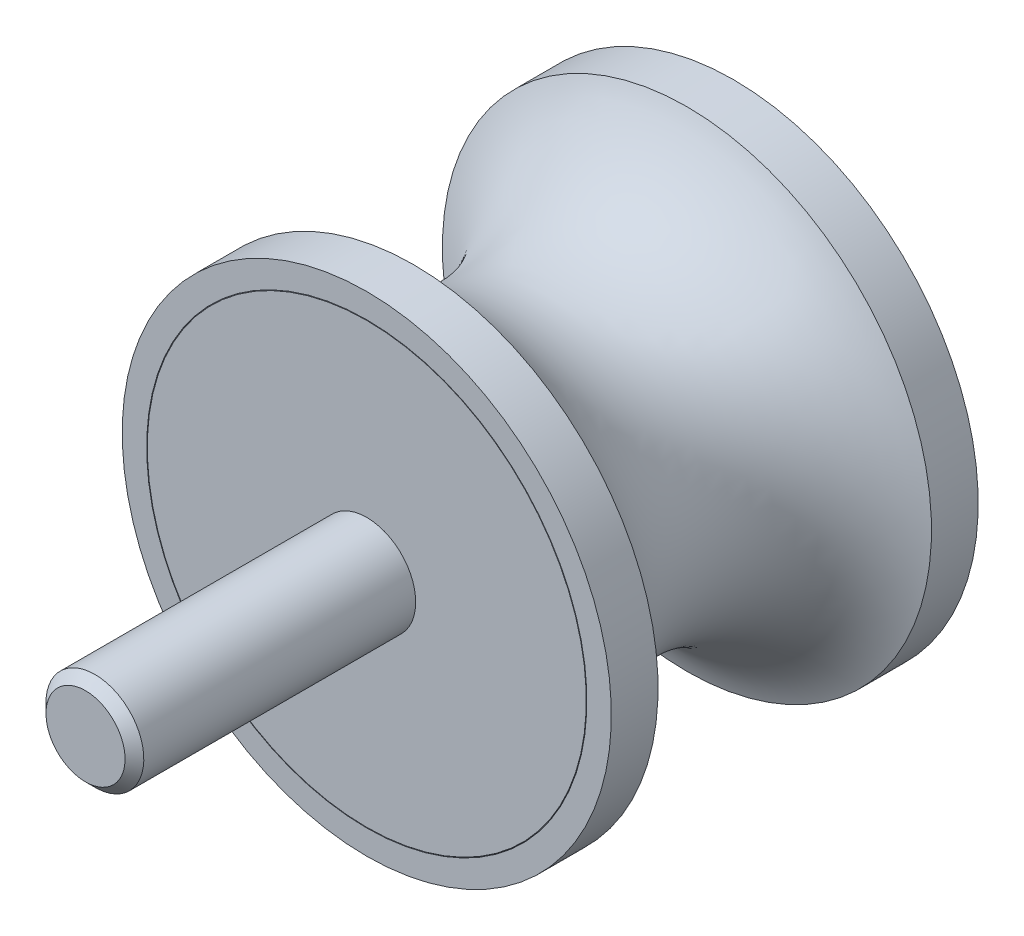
ISO-10303-21;
HEADER;
FILE_DESCRIPTION(('STEP AP214'),'2;1');
FILE_NAME('part.step','',(''),(''),'','','');
FILE_SCHEMA(('AUTOMOTIVE_DESIGN { 1 0 10303 214 1 1 1 1 }'));
ENDSEC;
DATA;
#1=APPLICATION_CONTEXT('core data for automotive mechanical design processes');
#2=APPLICATION_PROTOCOL_DEFINITION('international standard','automotive_design',2000,#1);
#3=PRODUCT_CONTEXT('',#1,'mechanical');
#4=PRODUCT('Part','Part','',(#3));
#5=PRODUCT_RELATED_PRODUCT_CATEGORY('part','',(#4));
#6=PRODUCT_DEFINITION_FORMATION('','',#4);
#7=PRODUCT_DEFINITION_CONTEXT('part definition',#1,'design');
#8=PRODUCT_DEFINITION('design','',#6,#7);
#9=PRODUCT_DEFINITION_SHAPE('','',#8);
#10=(LENGTH_UNIT() NAMED_UNIT(*) SI_UNIT(.MILLI.,.METRE.));
#11=(NAMED_UNIT(*) PLANE_ANGLE_UNIT() SI_UNIT($,.RADIAN.));
#12=(NAMED_UNIT(*) SI_UNIT($,.STERADIAN.) SOLID_ANGLE_UNIT());
#13=UNCERTAINTY_MEASURE_WITH_UNIT(LENGTH_MEASURE(1.E-05),#10,'distance_accuracy_value','');
#14=(GEOMETRIC_REPRESENTATION_CONTEXT(3) GLOBAL_UNCERTAINTY_ASSIGNED_CONTEXT((#13)) GLOBAL_UNIT_ASSIGNED_CONTEXT((#10,
#11,#12)) REPRESENTATION_CONTEXT('',''));
#15=CARTESIAN_POINT('',(0.,0.,0.));
#16=DIRECTION('',(0.,0.,1.));
#17=DIRECTION('',(1.,0.,0.));
#18=AXIS2_PLACEMENT_3D('',#15,#16,#17);
#19=CARTESIAN_POINT('',(0.,0.,0.5));
#20=DIRECTION('',(0.,0.,-1.));
#21=DIRECTION('',(0.,1.,0.));
#22=AXIS2_PLACEMENT_3D('',#19,#20,#21);
#23=CYLINDRICAL_SURFACE('',#22,18.);
#24=CARTESIAN_POINT('',(0.,0.,0.05));
#25=DIRECTION('',(0.,0.,-1.));
#26=DIRECTION('',(0.,1.,0.));
#27=AXIS2_PLACEMENT_3D('',#24,#25,#26);
#28=CIRCLE('',#27,18.);
#29=CARTESIAN_POINT('',(0.,18.,0.05));
#30=VERTEX_POINT('',#29);
#31=EDGE_CURVE('E53',#30,#30,#28,.T.);
#32=ORIENTED_EDGE('',*,*,#31,.F.);
#33=EDGE_LOOP('',(#32));
#34=FACE_BOUND('',#33,.T.);
#35=CARTESIAN_POINT('',(0.,0.,0.));
#36=DIRECTION('',(0.,0.,-1.));
#37=DIRECTION('',(0.,1.,0.));
#38=AXIS2_PLACEMENT_3D('',#35,#36,#37);
#39=CIRCLE('',#38,18.);
#40=CARTESIAN_POINT('',(0.,18.,0.));
#41=VERTEX_POINT('',#40);
#42=EDGE_CURVE('E44',#41,#41,#39,.T.);
#43=ORIENTED_EDGE('',*,*,#42,.T.);
#44=EDGE_LOOP('',(#43));
#45=FACE_BOUND('',#44,.T.);
#46=ADVANCED_FACE('F12',(#34,#45),#23,.F.);
#47=CARTESIAN_POINT('',(0.,0.,0.5));
#48=DIRECTION('',(0.,0.,-1.));
#49=DIRECTION('',(0.,1.,0.));
#50=AXIS2_PLACEMENT_3D('',#47,#48,#49);
#51=CYLINDRICAL_SURFACE('',#50,18.);
#52=CARTESIAN_POINT('',(0.,0.,30.));
#53=DIRECTION('',(0.,0.,-1.));
#54=DIRECTION('',(0.,1.,0.));
#55=AXIS2_PLACEMENT_3D('',#52,#53,#54);
#56=CIRCLE('',#55,18.);
#57=CARTESIAN_POINT('',(0.,18.,30.));
#58=VERTEX_POINT('',#57);
#59=EDGE_CURVE('E27',#58,#58,#56,.T.);
#60=ORIENTED_EDGE('',*,*,#59,.F.);
#61=EDGE_LOOP('',(#60));
#62=FACE_BOUND('',#61,.T.);
#63=CARTESIAN_POINT('',(0.,0.,29.95));
#64=DIRECTION('',(0.,0.,-1.));
#65=DIRECTION('',(0.,1.,0.));
#66=AXIS2_PLACEMENT_3D('',#63,#64,#65);
#67=CIRCLE('',#66,18.);
#68=CARTESIAN_POINT('',(0.,18.,29.95));
#69=VERTEX_POINT('',#68);
#70=EDGE_CURVE('E50',#69,#69,#67,.T.);
#71=ORIENTED_EDGE('',*,*,#70,.T.);
#72=EDGE_LOOP('',(#71));
#73=FACE_BOUND('',#72,.T.);
#74=ADVANCED_FACE('F89',(#62,#73),#51,.F.);
#75=CARTESIAN_POINT('',(18.,0.,30.));
#76=DIRECTION('',(0.,0.,-1.));
#77=DIRECTION('',(0.,1.,0.));
#78=AXIS2_PLACEMENT_3D('',#75,#76,#77);
#79=PLANE('',#78);
#80=CARTESIAN_POINT('',(0.,0.,30.));
#81=DIRECTION('',(0.,0.,-1.));
#82=DIRECTION('',(0.,1.,0.));
#83=AXIS2_PLACEMENT_3D('',#80,#81,#82);
#84=CIRCLE('',#83,20.);
#85=CARTESIAN_POINT('',(0.,20.,30.));
#86=VERTEX_POINT('',#85);
#87=EDGE_CURVE('E32',#86,#86,#84,.T.);
#88=ORIENTED_EDGE('',*,*,#87,.F.);
#89=EDGE_LOOP('',(#88));
#90=FACE_BOUND('',#89,.T.);
#91=ORIENTED_EDGE('',*,*,#59,.T.);
#92=EDGE_LOOP('',(#91));
#93=FACE_BOUND('',#92,.T.);
#94=ADVANCED_FACE('F115',(#90,#93),#79,.F.);
#95=CARTESIAN_POINT('',(0.,0.,0.5));
#96=DIRECTION('',(0.,0.,-1.));
#97=DIRECTION('',(0.,1.,0.));
#98=AXIS2_PLACEMENT_3D('',#95,#96,#97);
#99=CYLINDRICAL_SURFACE('',#98,20.);
#100=CARTESIAN_POINT('',(0.,0.,26.1803398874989));
#101=DIRECTION('',(0.,0.,-1.));
#102=DIRECTION('',(0.,1.,0.));
#103=AXIS2_PLACEMENT_3D('',#100,#101,#102);
#104=CIRCLE('',#103,20.);
#105=CARTESIAN_POINT('',(0.,20.,26.1803398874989));
#106=VERTEX_POINT('',#105);
#107=EDGE_CURVE('E35',#106,#106,#104,.T.);
#108=ORIENTED_EDGE('',*,*,#107,.F.);
#109=EDGE_LOOP('',(#108));
#110=FACE_BOUND('',#109,.T.);
#111=ORIENTED_EDGE('',*,*,#87,.T.);
#112=EDGE_LOOP('',(#111));
#113=FACE_BOUND('',#112,.T.);
#114=ADVANCED_FACE('F109',(#110,#113),#99,.T.);
#115=CARTESIAN_POINT('',(0.,0.,15.));
#116=DIRECTION('',(0.,0.,-1.));
#117=DIRECTION('',(0.,1.,0.));
#118=AXIS2_PLACEMENT_3D('',#115,#116,#117);
#119=TOROIDAL_SURFACE('',#118,24.5833333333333,12.0833333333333);
#120=CARTESIAN_POINT('',(0.,0.,3.81966011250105));
#121=DIRECTION('',(0.,0.,-1.));
#122=DIRECTION('',(0.,1.,0.));
#123=AXIS2_PLACEMENT_3D('',#120,#121,#122);
#124=CIRCLE('',#123,20.);
#125=CARTESIAN_POINT('',(0.,20.,3.81966011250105));
#126=VERTEX_POINT('',#125);
#127=EDGE_CURVE('E38',#126,#126,#124,.T.);
#128=ORIENTED_EDGE('',*,*,#127,.F.);
#129=EDGE_LOOP('',(#128));
#130=FACE_BOUND('',#129,.T.);
#131=ORIENTED_EDGE('',*,*,#107,.T.);
#132=EDGE_LOOP('',(#131));
#133=FACE_BOUND('',#132,.T.);
#134=ADVANCED_FACE('F103',(#130,#133),#119,.F.);
#135=CARTESIAN_POINT('',(0.,0.,0.5));
#136=DIRECTION('',(0.,0.,-1.));
#137=DIRECTION('',(0.,1.,0.));
#138=AXIS2_PLACEMENT_3D('',#135,#136,#137);
#139=CYLINDRICAL_SURFACE('',#138,20.);
#140=CARTESIAN_POINT('',(0.,0.,0.));
#141=DIRECTION('',(0.,0.,-1.));
#142=DIRECTION('',(0.,1.,0.));
#143=AXIS2_PLACEMENT_3D('',#140,#141,#142);
#144=CIRCLE('',#143,20.);
#145=CARTESIAN_POINT('',(0.,20.,0.));
#146=VERTEX_POINT('',#145);
#147=EDGE_CURVE('E41',#146,#146,#144,.T.);
#148=ORIENTED_EDGE('',*,*,#147,.F.);
#149=EDGE_LOOP('',(#148));
#150=FACE_BOUND('',#149,.T.);
#151=ORIENTED_EDGE('',*,*,#127,.T.);
#152=EDGE_LOOP('',(#151));
#153=FACE_BOUND('',#152,.T.);
#154=ADVANCED_FACE('F97',(#150,#153),#139,.T.);
#155=CARTESIAN_POINT('',(20.,0.,0.));
#156=DIRECTION('',(0.,0.,1.));
#157=DIRECTION('',(0.,-1.,0.));
#158=AXIS2_PLACEMENT_3D('',#155,#156,#157);
#159=PLANE('',#158);
#160=ORIENTED_EDGE('',*,*,#42,.F.);
#161=EDGE_LOOP('',(#160));
#162=FACE_BOUND('',#161,.T.);
#163=ORIENTED_EDGE('',*,*,#147,.T.);
#164=EDGE_LOOP('',(#163));
#165=FACE_BOUND('',#164,.T.);
#166=ADVANCED_FACE('F93',(#162,#165),#159,.F.);
#167=CARTESIAN_POINT('',(0.,0.,30.));
#168=DIRECTION('',(0.,0.,-1.));
#169=DIRECTION('',(0.,1.,0.));
#170=AXIS2_PLACEMENT_3D('',#167,#168,#169);
#171=PLANE('',#170);
#172=CARTESIAN_POINT('',(0.,0.,30.));
#173=DIRECTION('',(0.,0.,-1.));
#174=DIRECTION('',(0.,1.,0.));
#175=AXIS2_PLACEMENT_3D('',#172,#173,#174);
#176=CIRCLE('',#175,17.95);
#177=CARTESIAN_POINT('',(0.,17.95,30.));
#178=VERTEX_POINT('',#177);
#179=EDGE_CURVE('E47',#178,#178,#176,.T.);
#180=ORIENTED_EDGE('',*,*,#179,.F.);
#181=EDGE_LOOP('',(#180));
#182=FACE_BOUND('',#181,.T.);
#183=CARTESIAN_POINT('',(0.,0.,30.));
#184=DIRECTION('',(0.,0.,-1.));
#185=DIRECTION('',(0.,1.,0.));
#186=AXIS2_PLACEMENT_3D('',#183,#184,#185);
#187=CIRCLE('',#186,4.);
#188=CARTESIAN_POINT('',(0.,4.,30.));
#189=VERTEX_POINT('',#188);
#190=EDGE_CURVE('E8',#189,#189,#187,.T.);
#191=ORIENTED_EDGE('',*,*,#190,.T.);
#192=EDGE_LOOP('',(#191));
#193=FACE_BOUND('',#192,.T.);
#194=ADVANCED_FACE('F96',(#182,#193),#171,.F.);
#195=CARTESIAN_POINT('',(0.,0.,30.));
#196=DIRECTION('',(0.,0.,-1.));
#197=DIRECTION('',(0.,1.,0.));
#198=AXIS2_PLACEMENT_3D('',#195,#196,#197);
#199=CONICAL_SURFACE('',#198,17.95,0.785398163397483);
#200=ORIENTED_EDGE('',*,*,#70,.F.);
#201=EDGE_LOOP('',(#200));
#202=FACE_BOUND('',#201,.T.);
#203=ORIENTED_EDGE('',*,*,#179,.T.);
#204=EDGE_LOOP('',(#203));
#205=FACE_BOUND('',#204,.T.);
#206=ADVANCED_FACE('F129',(#202,#205),#199,.T.);
#207=CARTESIAN_POINT('',(0.,0.,53.));
#208=DIRECTION('',(0.,0.,-1.));
#209=DIRECTION('',(0.,1.,0.));
#210=AXIS2_PLACEMENT_3D('',#207,#208,#209);
#211=PLANE('',#210);
#212=CARTESIAN_POINT('',(0.,0.,53.));
#213=DIRECTION('',(0.,0.,-1.));
#214=DIRECTION('',(0.,1.,0.));
#215=AXIS2_PLACEMENT_3D('',#212,#213,#214);
#216=CIRCLE('',#215,3.233);
#217=CARTESIAN_POINT('',(0.,3.233,53.));
#218=VERTEX_POINT('',#217);
#219=EDGE_CURVE('E19',#218,#218,#216,.T.);
#220=ORIENTED_EDGE('',*,*,#219,.F.);
#221=EDGE_LOOP('',(#220));
#222=FACE_BOUND('',#221,.T.);
#223=ADVANCED_FACE('F14',(#222),#211,.F.);
#224=CARTESIAN_POINT('',(0.,0.,53.));
#225=DIRECTION('',(0.,0.,-1.));
#226=DIRECTION('',(0.,1.,0.));
#227=AXIS2_PLACEMENT_3D('',#224,#225,#226);
#228=CONICAL_SURFACE('',#227,3.233,0.785398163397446);
#229=CARTESIAN_POINT('',(0.,0.,52.233));
#230=DIRECTION('',(0.,0.,-1.));
#231=DIRECTION('',(0.,1.,0.));
#232=AXIS2_PLACEMENT_3D('',#229,#230,#231);
#233=CIRCLE('',#232,4.);
#234=CARTESIAN_POINT('',(0.,4.,52.233));
#235=VERTEX_POINT('',#234);
#236=EDGE_CURVE('E23',#235,#235,#233,.T.);
#237=ORIENTED_EDGE('',*,*,#236,.F.);
#238=EDGE_LOOP('',(#237));
#239=FACE_BOUND('',#238,.T.);
#240=ORIENTED_EDGE('',*,*,#219,.T.);
#241=EDGE_LOOP('',(#240));
#242=FACE_BOUND('',#241,.T.);
#243=ADVANCED_FACE('F142',(#239,#242),#228,.T.);
#244=CARTESIAN_POINT('',(0.,0.,0.5));
#245=DIRECTION('',(0.,0.,-1.));
#246=DIRECTION('',(0.,1.,0.));
#247=AXIS2_PLACEMENT_3D('',#244,#245,#246);
#248=CYLINDRICAL_SURFACE('',#247,4.);
#249=ORIENTED_EDGE('',*,*,#190,.F.);
#250=EDGE_LOOP('',(#249));
#251=FACE_BOUND('',#250,.T.);
#252=ORIENTED_EDGE('',*,*,#236,.T.);
#253=EDGE_LOOP('',(#252));
#254=FACE_BOUND('',#253,.T.);
#255=ADVANCED_FACE('F83',(#251,#254),#248,.T.);
#256=CARTESIAN_POINT('',(0.,0.,0.05));
#257=DIRECTION('',(0.,0.,1.));
#258=DIRECTION('',(0.,-1.,0.));
#259=AXIS2_PLACEMENT_3D('',#256,#257,#258);
#260=CONICAL_SURFACE('',#259,18.,0.785398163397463);
#261=CARTESIAN_POINT('',(0.,0.,0.));
#262=DIRECTION('',(0.,0.,-1.));
#263=DIRECTION('',(0.,1.,0.));
#264=AXIS2_PLACEMENT_3D('',#261,#262,#263);
#265=CIRCLE('',#264,17.95);
#266=CARTESIAN_POINT('',(0.,17.95,0.));
#267=VERTEX_POINT('',#266);
#268=EDGE_CURVE('E56',#267,#267,#265,.T.);
#269=ORIENTED_EDGE('',*,*,#268,.F.);
#270=EDGE_LOOP('',(#269));
#271=FACE_BOUND('',#270,.T.);
#272=ORIENTED_EDGE('',*,*,#31,.T.);
#273=EDGE_LOOP('',(#272));
#274=FACE_BOUND('',#273,.T.);
#275=ADVANCED_FACE('F77',(#271,#274),#260,.T.);
#276=CARTESIAN_POINT('',(17.95,0.,0.));
#277=DIRECTION('',(0.,0.,1.));
#278=DIRECTION('',(0.,-1.,0.));
#279=AXIS2_PLACEMENT_3D('',#276,#277,#278);
#280=PLANE('',#279);
#281=CARTESIAN_POINT('',(0.,0.,0.));
#282=DIRECTION('',(0.,0.,-1.));
#283=DIRECTION('',(0.,1.,0.));
#284=AXIS2_PLACEMENT_3D('',#281,#282,#283);
#285=CIRCLE('',#284,4.);
#286=CARTESIAN_POINT('',(0.,4.,0.));
#287=VERTEX_POINT('',#286);
#288=EDGE_CURVE('E60',#287,#287,#285,.T.);
#289=ORIENTED_EDGE('',*,*,#288,.F.);
#290=EDGE_LOOP('',(#289));
#291=FACE_BOUND('',#290,.T.);
#292=ORIENTED_EDGE('',*,*,#268,.T.);
#293=EDGE_LOOP('',(#292));
#294=FACE_BOUND('',#293,.T.);
#295=ADVANCED_FACE('F71',(#291,#294),#280,.F.);
#296=CARTESIAN_POINT('',(0.,0.,8.));
#297=DIRECTION('',(0.,0.,-1.));
#298=DIRECTION('',(0.,1.,0.));
#299=AXIS2_PLACEMENT_3D('',#296,#297,#298);
#300=CYLINDRICAL_SURFACE('',#299,4.);
#301=CARTESIAN_POINT('',(0.,0.,8.));
#302=DIRECTION('',(0.,0.,-1.));
#303=DIRECTION('',(0.,1.,0.));
#304=AXIS2_PLACEMENT_3D('',#301,#302,#303);
#305=CIRCLE('',#304,4.);
#306=CARTESIAN_POINT('',(0.,4.,8.));
#307=VERTEX_POINT('',#306);
#308=EDGE_CURVE('E59',#307,#307,#305,.T.);
#309=ORIENTED_EDGE('',*,*,#308,.F.);
#310=EDGE_LOOP('',(#309));
#311=FACE_BOUND('',#310,.T.);
#312=ORIENTED_EDGE('',*,*,#288,.T.);
#313=EDGE_LOOP('',(#312));
#314=FACE_BOUND('',#313,.T.);
#315=ADVANCED_FACE('F68',(#311,#314),#300,.F.);
#316=CARTESIAN_POINT('',(0.,0.,8.));
#317=DIRECTION('',(0.,0.,-1.));
#318=DIRECTION('',(0.,1.,0.));
#319=AXIS2_PLACEMENT_3D('',#316,#317,#318);
#320=PLANE('',#319);
#321=ORIENTED_EDGE('',*,*,#308,.T.);
#322=EDGE_LOOP('',(#321));
#323=FACE_BOUND('',#322,.T.);
#324=ADVANCED_FACE('F66',(#323),#320,.T.);
#325=CLOSED_SHELL('',(#46,#74,#94,#114,#134,#154,#166,#194,#206,#223,#243,#255,#275,#295,#315,#324));
#326=MANIFOLD_SOLID_BREP('B1',#325);
#327=ADVANCED_BREP_SHAPE_REPRESENTATION('',(#18,#326),#14);
#328=SHAPE_DEFINITION_REPRESENTATION(#9,#327);
ENDSEC;
END-ISO-10303-21;
